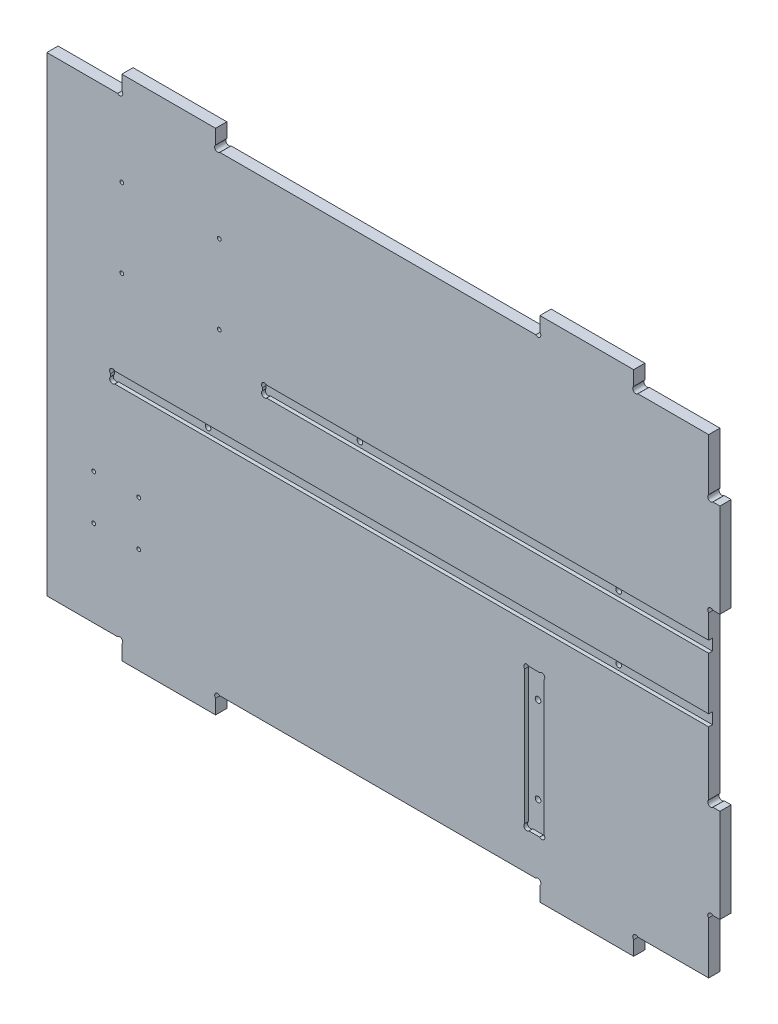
from build123d import *

# Parameters (mm, degrees)
ESQUISSE1_W              = 353
ESQUISSE1_H              = 251
BASE_EXTRUSION_DEPTH     = 6
ESQUISSE2_W              = 10.2
ESQUISSE2_H              = 76
ENL_V_MAT_EXTRU_1_DEPTH  = 2
ESQUISSE4_W              = 238
ESQUISSE4_H              = 6
ESQUISSE4_W_2            = 319
ENL_V_MAT_EXTRU_3_DEPTH  = 2
ENL_V_START              = -6
ESQUISSE8_R              = 1
ENL_V_MAT_EXTRU_7_DEPTH  = 6
ESQUISSE3_R              = 1.5
ENL_V_MAT_EXTRU_2_DEPTH  = 4
ESQUISSE9_R              = 1.6
ENL_V_MAT_EXTRU_8_DEPTH  = 2
ESQUISSE10_W             = 6
ESQUISSE10_H             = 50
EXTRUSION1_DEPTH         = 6
ESQUISSE13_W             = 50
ESQUISSE13_H             = 6
EXTRUSION2_DEPTH         = 10
ESQUISSE15_W             = 50
ESQUISSE15_H             = 6
EXTRUSION3_DEPTH         = 10
ESQUISSE11_R             = 1.6
ENL_V_MAT_EXTRU_9_DEPTH  = 6
ESQUISSE16_R             = 1
ENL_V_MAT_EXTRU_10_DEPTH = 6


with BuildPart() as part:
    # Esquisse1 → Base-Extrusion (new body)
    with BuildSketch(Plane.XY):
        with Locations((158.633031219, -87.374420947)):
            Rectangle(ESQUISSE1_W, ESQUISSE1_H)
    extrude(amount=BASE_EXTRUSION_DEPTH)

    # Esquisse2 → Enl_v. mat.-Extru.1 (cut)
    with BuildSketch(Plane.XY.offset(6)):
        with Locations((242.133031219, -154.874420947)):
            Rectangle(ESQUISSE2_W, ESQUISSE2_H)
    extrude(amount=-ENL_V_MAT_EXTRU_1_DEPTH, mode=Mode.SUBTRACT)

    # Esquisse4 → Enl_v. mat.-Extru.3 (cut)
    with BuildSketch(Plane.XY.offset(6)):
        with Locations((216.133031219, -59.874420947)):
            Rectangle(ESQUISSE4_W, ESQUISSE4_H)
        with Locations((175.633031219, -93.874420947)):
            Rectangle(ESQUISSE4_W_2, ESQUISSE4_H)
    extrude(amount=-ENL_V_MAT_EXTRU_3_DEPTH, mode=Mode.SUBTRACT)

    # Esquisse8 → Enl_v. mat.-Extru.7 (cut)
    with BuildSketch(Plane.XY.offset(6).offset(ENL_V_START)):
        with Locations((7.133031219, -166.874420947)):
            Circle(ESQUISSE8_R)
        with Locations((7.133031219, -142.874420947)):
            Circle(ESQUISSE8_R)
        with Locations((31.133031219, -166.874420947)):
            Circle(ESQUISSE8_R)
        with Locations((31.133031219, -142.874420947)):
            Circle(ESQUISSE8_R)
    extrude(amount=ENL_V_MAT_EXTRU_7_DEPTH, mode=Mode.SUBTRACT)

    # Esquisse3 → Enl_v. mat.-Extru.2 (cut)
    with BuildSketch(Plane.XY.offset(4)):
        with Locations((242.133031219, -177.874420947)):
            Circle(ESQUISSE3_R)
        with Locations((285.133031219, -59.974420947)):
            Circle(ESQUISSE3_R)
        with Locations((242.133031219, -131.874420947)):
            Circle(ESQUISSE3_R)
        with Locations((147.133031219, -59.974420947)):
            Circle(ESQUISSE3_R)
        with Locations((285.133031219, -93.974420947)):
            Circle(ESQUISSE3_R)
        with Locations((66.133031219, -93.974420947)):
            Circle(ESQUISSE3_R)
    extrude(amount=-ENL_V_MAT_EXTRU_2_DEPTH, mode=Mode.SUBTRACT)

    # Esquisse9 → Enl_v. mat.-Extru.8 (cut)
    with BuildSketch(Plane.XY.offset(6)):
        with Locations((246.133031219, -117.974420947)):
            Circle(ESQUISSE9_R)
        with Locations((238.133031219, -117.974420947)):
            Circle(ESQUISSE9_R)
        with Locations((246.133031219, -191.774420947)):
            Circle(ESQUISSE9_R)
        with Locations((238.133031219, -191.774420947)):
            Circle(ESQUISSE9_R)
        with Locations((98.233031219, -57.974420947)):
            Circle(ESQUISSE9_R)
        with Locations((98.233031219, -61.774420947)):
            Circle(ESQUISSE9_R)
        with Locations((17.233031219, -91.974420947)):
            Circle(ESQUISSE9_R)
        with Locations((17.233031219, -95.774420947)):
            Circle(ESQUISSE9_R)
    extrude(amount=-ENL_V_MAT_EXTRU_8_DEPTH, mode=Mode.SUBTRACT)

    # Esquisse10 → Extrusion1 (add)
    with BuildSketch(Plane(origin=(335.133031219, 0, 0), x_dir=(0, 0, -1), z_dir=(1, 0, 0))):
        with Locations((-3, -16.874420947)):
            Rectangle(ESQUISSE10_W, ESQUISSE10_H)
        with Locations((-3, -157.874420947)):
            Rectangle(ESQUISSE10_W, ESQUISSE10_H)
    extrude(amount=EXTRUSION1_DEPTH)

    # Esquisse13 → Extrusion2 (add)
    with BuildSketch(Plane.XZ.offset(212.874420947)):
        with Locations((47.133031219, 3)):
            Rectangle(ESQUISSE13_W, ESQUISSE13_H)
        with Locations((270.133031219, 3)):
            Rectangle(ESQUISSE13_W, ESQUISSE13_H)
    extrude(amount=EXTRUSION2_DEPTH)

    # Esquisse15 → Extrusion3 (add)
    with BuildSketch(Plane(origin=(0, 38.125579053, 0), x_dir=(-1, 0, 0), z_dir=(0, 1, 0))):
        with Locations((-270.133031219, 3)):
            Rectangle(ESQUISSE15_W, ESQUISSE15_H)
        with Locations((-47.133031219, 3)):
            Rectangle(ESQUISSE15_W, ESQUISSE15_H)
    extrude(amount=EXTRUSION3_DEPTH)

    # Esquisse11 → Enl_v. mat.-Extru.9 (cut)
    with BuildSketch(Plane.XY.offset(6).offset(ENL_V_START)):
        with Locations((336.233031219, 9.225579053)):
            Circle(ESQUISSE11_R)
        with Locations((336.233031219, -42.974420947)):
            Circle(ESQUISSE11_R)
        with Locations((336.233031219, -131.774420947)):
            Circle(ESQUISSE11_R)
        with Locations((336.233031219, -183.974420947)):
            Circle(ESQUISSE11_R)
        with Locations((21.033031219, -213.974420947)):
            Circle(ESQUISSE11_R)
        with Locations((73.233031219, -213.974420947)):
            Circle(ESQUISSE11_R)
        with Locations((296.233031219, -213.974420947)):
            Circle(ESQUISSE11_R)
        with Locations((244.033031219, -213.974420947)):
            Circle(ESQUISSE11_R)
        with Locations((244.033031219, 39.225579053)):
            Circle(ESQUISSE11_R)
        with Locations((296.233031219, 39.225579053)):
            Circle(ESQUISSE11_R)
        with Locations((21.033031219, 39.225579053)):
            Circle(ESQUISSE11_R)
        with Locations((73.233031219, 39.225579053)):
            Circle(ESQUISSE11_R)
    extrude(amount=ENL_V_MAT_EXTRU_9_DEPTH, mode=Mode.SUBTRACT)

    # Esquisse16 → Enl_v. mat.-Extru.10 (cut)
    with BuildSketch(Plane.XY.offset(6).offset(ENL_V_START)):
        with Locations((22.133031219, -43.874420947)):
            Circle(ESQUISSE16_R)
        with Locations((22.133031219, -1.874420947)):
            Circle(ESQUISSE16_R)
        with Locations((74.133031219, -1.874420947)):
            Circle(ESQUISSE16_R)
        with Locations((74.133031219, -43.874420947)):
            Circle(ESQUISSE16_R)
    extrude(amount=ENL_V_MAT_EXTRU_10_DEPTH, mode=Mode.SUBTRACT)


solid = part.part
